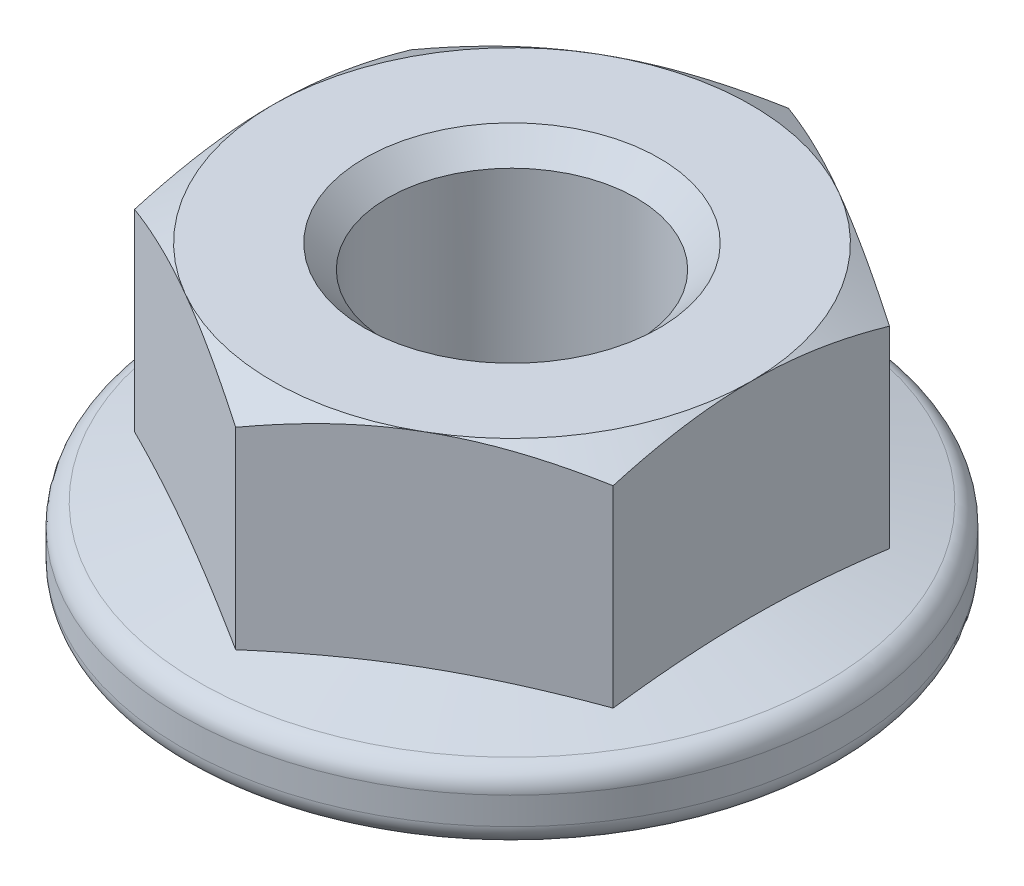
ISO-10303-21;
HEADER;
FILE_DESCRIPTION(('STEP AP214'),'2;1');
FILE_NAME('part.step','',(''),(''),'','','');
FILE_SCHEMA(('AUTOMOTIVE_DESIGN { 1 0 10303 214 1 1 1 1 }'));
ENDSEC;
DATA;
#1=APPLICATION_CONTEXT('core data for automotive mechanical design processes');
#2=APPLICATION_PROTOCOL_DEFINITION('international standard','automotive_design',2000,#1);
#3=PRODUCT_CONTEXT('',#1,'mechanical');
#4=PRODUCT('Part','Part','',(#3));
#5=PRODUCT_RELATED_PRODUCT_CATEGORY('part','',(#4));
#6=PRODUCT_DEFINITION_FORMATION('','',#4);
#7=PRODUCT_DEFINITION_CONTEXT('part definition',#1,'design');
#8=PRODUCT_DEFINITION('design','',#6,#7);
#9=PRODUCT_DEFINITION_SHAPE('','',#8);
#10=(LENGTH_UNIT() NAMED_UNIT(*) SI_UNIT(.MILLI.,.METRE.));
#11=(NAMED_UNIT(*) PLANE_ANGLE_UNIT() SI_UNIT($,.RADIAN.));
#12=(NAMED_UNIT(*) SI_UNIT($,.STERADIAN.) SOLID_ANGLE_UNIT());
#13=UNCERTAINTY_MEASURE_WITH_UNIT(LENGTH_MEASURE(1.E-05),#10,'distance_accuracy_value','');
#14=(GEOMETRIC_REPRESENTATION_CONTEXT(3) GLOBAL_UNCERTAINTY_ASSIGNED_CONTEXT((#13)) GLOBAL_UNIT_ASSIGNED_CONTEXT((#10,
#11,#12)) REPRESENTATION_CONTEXT('',''));
#15=CARTESIAN_POINT('',(0.,0.,0.));
#16=DIRECTION('',(0.,0.,1.));
#17=DIRECTION('',(1.,0.,0.));
#18=AXIS2_PLACEMENT_3D('',#15,#16,#17);
#19=CARTESIAN_POINT('',(0.,-6.660396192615,0.));
#20=DIRECTION('',(0.,-1.,0.));
#21=DIRECTION('',(0.,0.,-1.));
#22=AXIS2_PLACEMENT_3D('',#19,#20,#21);
#23=CYLINDRICAL_SURFACE('',#22,8.95);
#24=CARTESIAN_POINT('',(0.,-7.4,0.));
#25=DIRECTION('',(0.,-1.,0.));
#26=DIRECTION('',(0.999990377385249,0.,0.00438692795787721));
#27=AXIS2_PLACEMENT_3D('',#24,#25,#26);
#28=CIRCLE('',#27,8.95);
#29=CARTESIAN_POINT('',(8.94991387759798,-7.4,0.0392630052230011));
#30=VERTEX_POINT('',#29);
#31=EDGE_CURVE('E519',#30,#30,#28,.T.);
#32=ORIENTED_EDGE('',*,*,#31,.F.);
#33=EDGE_LOOP('',(#32));
#34=FACE_BOUND('',#33,.T.);
#35=CARTESIAN_POINT('',(0.,-6.660396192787,0.));
#36=DIRECTION('',(0.,-1.,0.));
#37=DIRECTION('',(-0.999987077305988,0.,-0.00508381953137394));
#38=AXIS2_PLACEMENT_3D('',#35,#36,#37);
#39=CIRCLE('',#38,8.95);
#40=CARTESIAN_POINT('',(-8.94988434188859,-6.660396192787,-0.0455001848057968));
#41=VERTEX_POINT('',#40);
#42=EDGE_CURVE('E107',#41,#41,#39,.F.);
#43=ORIENTED_EDGE('',*,*,#42,.F.);
#44=EDGE_LOOP('',(#43));
#45=FACE_BOUND('',#44,.T.);
#46=ADVANCED_FACE('F14',(#34,#45),#23,.T.);
#47=CARTESIAN_POINT('',(0.,-7.4,0.));
#48=DIRECTION('',(0.,-1.,0.));
#49=DIRECTION('',(0.999990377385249,0.,0.00438692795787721));
#50=AXIS2_PLACEMENT_3D('',#47,#48,#49);
#51=TOROIDAL_SURFACE('',#50,8.35,0.6);
#52=CARTESIAN_POINT('',(0.,-8.,0.));
#53=DIRECTION('',(0.,1.,0.));
#54=DIRECTION('',(-1.,0.,0.));
#55=AXIS2_PLACEMENT_3D('',#52,#53,#54);
#56=CIRCLE('',#55,8.350000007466);
#57=CARTESIAN_POINT('',(8.3500000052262,-8.,0.));
#58=VERTEX_POINT('',#57);
#59=CARTESIAN_POINT('',(-8.3500000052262,-8.,0.));
#60=VERTEX_POINT('',#59);
#61=EDGE_CURVE('E94',#58,#60,#56,.F.);
#62=ORIENTED_EDGE('',*,*,#61,.F.);
#63=CARTESIAN_POINT('',(0.,-8.,0.));
#64=DIRECTION('',(0.,1.,0.));
#65=DIRECTION('',(1.,0.,0.));
#66=AXIS2_PLACEMENT_3D('',#63,#64,#65);
#67=CIRCLE('',#66,8.350000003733);
#68=EDGE_CURVE('E97',#60,#58,#67,.F.);
#69=ORIENTED_EDGE('',*,*,#68,.F.);
#70=EDGE_LOOP('',(#62,#69));
#71=FACE_BOUND('',#70,.T.);
#72=ORIENTED_EDGE('',*,*,#31,.T.);
#73=EDGE_LOOP('',(#72));
#74=FACE_BOUND('',#73,.T.);
#75=ADVANCED_FACE('F105',(#71,#74),#51,.T.);
#76=CARTESIAN_POINT('',(0.,-6.660396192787,0.));
#77=DIRECTION('',(0.,-1.,0.));
#78=DIRECTION('',(-0.999987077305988,0.,-0.00508381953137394));
#79=AXIS2_PLACEMENT_3D('',#76,#77,#78);
#80=TOROIDAL_SURFACE('',#79,8.35,0.6);
#81=ORIENTED_EDGE('',*,*,#42,.T.);
#82=EDGE_LOOP('',(#81));
#83=FACE_BOUND('',#82,.T.);
#84=CARTESIAN_POINT('',(0.,-6.08084069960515,0.));
#85=DIRECTION('',(0.,-1.,0.));
#86=DIRECTION('',(-1.,0.,0.));
#87=AXIS2_PLACEMENT_3D('',#84,#85,#86);
#88=CIRCLE('',#87,8.50529143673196);
#89=CARTESIAN_POINT('',(-8.50529143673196,-6.08084069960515,0.));
#90=VERTEX_POINT('',#89);
#91=EDGE_CURVE('E102',#90,#90,#88,.F.);
#92=ORIENTED_EDGE('',*,*,#91,.F.);
#93=EDGE_LOOP('',(#92));
#94=FACE_BOUND('',#93,.T.);
#95=ADVANCED_FACE('F343',(#83,#94),#80,.T.);
#96=CARTESIAN_POINT('',(0.,-8.,0.));
#97=DIRECTION('',(0.,-1.,0.));
#98=DIRECTION('',(0.,0.,-1.));
#99=AXIS2_PLACEMENT_3D('',#96,#97,#98);
#100=PLANE('',#99);
#101=CARTESIAN_POINT('',(0.,-7.99999999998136,0.));
#102=DIRECTION('',(0.,-1.,0.));
#103=DIRECTION('',(0.,0.,-1.));
#104=AXIS2_PLACEMENT_3D('',#101,#102,#103);
#105=CIRCLE('',#104,4.00000000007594);
#106=CARTESIAN_POINT('',(0.,-7.99999999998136,-4.00000000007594));
#107=VERTEX_POINT('',#106);
#108=EDGE_CURVE('E109',#107,#107,#105,.F.);
#109=ORIENTED_EDGE('',*,*,#108,.T.);
#110=EDGE_LOOP('',(#109));
#111=FACE_BOUND('',#110,.T.);
#112=ORIENTED_EDGE('',*,*,#61,.T.);
#113=ORIENTED_EDGE('',*,*,#68,.T.);
#114=EDGE_LOOP('',(#112,#113));
#115=FACE_BOUND('',#114,.T.);
#116=ADVANCED_FACE('F99',(#111,#115),#100,.T.);
#117=CARTESIAN_POINT('',(0.,-6.08084069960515,0.));
#118=DIRECTION('',(0.,-1.,0.));
#119=DIRECTION('',(0.,0.,-1.));
#120=AXIS2_PLACEMENT_3D('',#117,#118,#119);
#121=CONICAL_SURFACE('',#120,8.50529143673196,1.3089969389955);
#122=CARTESIAN_POINT('',(6.49999999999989,-5.81296172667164,3.75277674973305));
#123=CARTESIAN_POINT('',(6.49999999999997,-5.77118780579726,3.4410899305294));
#124=CARTESIAN_POINT('',(6.49999999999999,-5.73326410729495,3.12883802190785));
#125=CARTESIAN_POINT('',(6.50000000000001,-5.66663588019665,2.50323156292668));
#126=CARTESIAN_POINT('',(6.5,-5.63793509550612,2.18987661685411));
#127=CARTESIAN_POINT('',(6.50000000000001,-5.5914280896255,1.56396377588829));
#128=CARTESIAN_POINT('',(6.50000000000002,-5.57356641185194,1.2514101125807));
#129=CARTESIAN_POINT('',(6.49999999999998,-5.54961574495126,0.625904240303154));
#130=CARTESIAN_POINT('',(6.49999999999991,-5.54352447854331,0.312952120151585));
#131=CARTESIAN_POINT('',(6.49999999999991,-5.54352447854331,-0.312952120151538));
#132=CARTESIAN_POINT('',(6.49999999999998,-5.54961574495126,-0.625904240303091));
#133=CARTESIAN_POINT('',(6.50000000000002,-5.57356641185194,-1.25141011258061));
#134=CARTESIAN_POINT('',(6.50000000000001,-5.5914280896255,-1.56396377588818));
#135=CARTESIAN_POINT('',(6.49999999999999,-5.63793509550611,-2.18987661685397));
#136=CARTESIAN_POINT('',(6.5,-5.66663588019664,-2.50323156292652));
#137=CARTESIAN_POINT('',(6.5,-5.73326410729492,-3.12883802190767));
#138=CARTESIAN_POINT('',(6.50000000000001,-5.7711878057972,-3.4410899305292));
#139=CARTESIAN_POINT('',(6.5,-5.81296172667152,-3.75277674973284));
#140=B_SPLINE_CURVE_WITH_KNOTS('',3,(#122,#123,#124,#125,#126,#127,#128,#129,#130,#131,#132,
#133,#134,#135,#136,#137,#138,#139),.UNSPECIFIED.,.F.,.F.,(4,2,2,2,2,2,2,2,4),(0.,
0.943470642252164,1.88732379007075,2.82630622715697,3.76510697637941,4.7039077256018,
5.64289016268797,6.58674331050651,7.53021395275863),.UNSPECIFIED.);
#141=CARTESIAN_POINT('',(6.50000000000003,-5.81296172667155,3.75277674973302));
#142=VERTEX_POINT('',#141);
#143=CARTESIAN_POINT('',(6.49999999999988,-5.81296172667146,-3.75277674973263));
#144=VERTEX_POINT('',#143);
#145=EDGE_CURVE('E86',#142,#144,#140,.T.);
#146=ORIENTED_EDGE('',*,*,#145,.F.);
#147=CARTESIAN_POINT('',(2.71094881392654E-13,-5.8129617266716,7.50555349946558));
#148=CARTESIAN_POINT('',(0.269928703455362,-5.7711878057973,7.34971008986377));
#149=CARTESIAN_POINT('',(0.540346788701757,-5.73326410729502,7.19358413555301));
#150=CARTESIAN_POINT('',(1.08213787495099,-5.66663588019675,6.88078090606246));
#151=CARTESIAN_POINT('',(1.35351121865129,-5.63793509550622,6.7241034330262));
#152=CARTESIAN_POINT('',(1.8955676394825,-5.59142808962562,6.41114701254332));
#153=CARTESIAN_POINT('',(2.16624705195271,-5.57356641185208,6.25487018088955));
#154=CARTESIAN_POINT('',(2.70795102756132,-5.54961574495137,5.94211724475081));
#155=CARTESIAN_POINT('',(2.97897551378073,-5.54352447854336,5.78564118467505));
#156=CARTESIAN_POINT('',(3.52102448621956,-5.54352447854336,5.47268906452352));
#157=CARTESIAN_POINT('',(3.79204897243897,-5.54961574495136,5.31621300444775));
#158=CARTESIAN_POINT('',(4.33375294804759,-5.57356641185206,5.00346006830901));
#159=CARTESIAN_POINT('',(4.6044323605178,-5.59142808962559,4.84718323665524));
#160=CARTESIAN_POINT('',(5.146488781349,-5.63793509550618,4.53422681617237));
#161=CARTESIAN_POINT('',(5.4178621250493,-5.66663588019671,4.3775493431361));
#162=CARTESIAN_POINT('',(5.95965321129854,-5.73326410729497,4.06474611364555));
#163=CARTESIAN_POINT('',(6.23007129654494,-5.77118780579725,3.9086201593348));
#164=CARTESIAN_POINT('',(6.50000000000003,-5.81296172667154,3.75277674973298));
#165=B_SPLINE_CURVE_WITH_KNOTS('',3,(#147,#148,#149,#150,#151,#152,#153,#154,#155,#156,#157,
#158,#159,#160,#161,#162,#163,#164),.UNSPECIFIED.,.F.,.F.,(4,2,2,2,2,2,2,2,4),(0.,
0.943470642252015,1.88732379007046,2.82630622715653,3.76510697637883,4.70390772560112,
5.64289016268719,6.58674331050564,7.53021395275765),.UNSPECIFIED.);
#166=CARTESIAN_POINT('',(2.61171548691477E-13,-5.81296172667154,7.50555349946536));
#167=VERTEX_POINT('',#166);
#168=EDGE_CURVE('E303',#167,#142,#165,.T.);
#169=ORIENTED_EDGE('',*,*,#168,.F.);
#170=CARTESIAN_POINT('',(-6.49999999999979,-5.81296172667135,3.75277674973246));
#171=CARTESIAN_POINT('',(-6.23007129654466,-5.77118780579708,3.90862015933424));
#172=CARTESIAN_POINT('',(-5.95965321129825,-5.73326410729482,4.06474611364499));
#173=CARTESIAN_POINT('',(-5.41786212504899,-5.66663588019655,4.37754934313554));
#174=CARTESIAN_POINT('',(-5.14648878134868,-5.63793509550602,4.53422681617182));
#175=CARTESIAN_POINT('',(-4.60443236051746,-5.59142808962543,4.84718323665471));
#176=CARTESIAN_POINT('',(-4.33375294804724,-5.57356641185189,5.00346006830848));
#177=CARTESIAN_POINT('',(-3.7920489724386,-5.54961574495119,5.31621300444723));
#178=CARTESIAN_POINT('',(-3.52102448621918,-5.54352447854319,5.472689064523));
#179=CARTESIAN_POINT('',(-2.97897551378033,-5.54352447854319,5.78564118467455));
#180=CARTESIAN_POINT('',(-2.70795102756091,-5.5496157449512,5.94211724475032));
#181=CARTESIAN_POINT('',(-2.16624705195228,-5.57356641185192,6.25487018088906));
#182=CARTESIAN_POINT('',(-1.89556763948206,-5.59142808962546,6.41114701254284));
#183=CARTESIAN_POINT('',(-1.35351121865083,-5.63793509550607,6.72410343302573));
#184=CARTESIAN_POINT('',(-1.08213787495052,-5.6666358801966,6.880780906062));
#185=CARTESIAN_POINT('',(-0.540346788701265,-5.73326410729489,7.19358413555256));
#186=CARTESIAN_POINT('',(-0.26992870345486,-5.77118780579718,7.34971008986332));
#187=CARTESIAN_POINT('',(2.40259230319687E-13,-5.81296172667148,7.50555349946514));
#188=B_SPLINE_CURVE_WITH_KNOTS('',3,(#170,#171,#172,#173,#174,#175,#176,#177,#178,#179,#180,
#181,#182,#183,#184,#185,#186,#187),.UNSPECIFIED.,.F.,.F.,(4,2,2,2,2,2,2,2,4),(0.,
0.94347064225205,1.88732379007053,2.82630622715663,3.76510697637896,4.70390772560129,
5.6428901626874,6.58674331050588,7.53021395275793),.UNSPECIFIED.);
#189=CARTESIAN_POINT('',(-6.49999999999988,-5.81296172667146,3.75277674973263));
#190=VERTEX_POINT('',#189);
#191=EDGE_CURVE('E293',#190,#167,#188,.T.);
#192=ORIENTED_EDGE('',*,*,#191,.F.);
#193=CARTESIAN_POINT('',(-6.49999999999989,-5.81296172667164,-3.75277674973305));
#194=CARTESIAN_POINT('',(-6.49999999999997,-5.77118780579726,-3.4410899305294));
#195=CARTESIAN_POINT('',(-6.49999999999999,-5.73326410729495,-3.12883802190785));
#196=CARTESIAN_POINT('',(-6.50000000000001,-5.66663588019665,-2.50323156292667));
#197=CARTESIAN_POINT('',(-6.5,-5.63793509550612,-2.1898766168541));
#198=CARTESIAN_POINT('',(-6.50000000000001,-5.5914280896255,-1.56396377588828));
#199=CARTESIAN_POINT('',(-6.50000000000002,-5.57356641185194,-1.25141011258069));
#200=CARTESIAN_POINT('',(-6.49999999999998,-5.54961574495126,-0.625904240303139));
#201=CARTESIAN_POINT('',(-6.49999999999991,-5.54352447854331,-0.312952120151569));
#202=CARTESIAN_POINT('',(-6.49999999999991,-5.54352447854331,0.312952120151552));
#203=CARTESIAN_POINT('',(-6.49999999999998,-5.54961574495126,0.625904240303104));
#204=CARTESIAN_POINT('',(-6.50000000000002,-5.57356641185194,1.25141011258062));
#205=CARTESIAN_POINT('',(-6.50000000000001,-5.5914280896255,1.56396377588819));
#206=CARTESIAN_POINT('',(-6.49999999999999,-5.63793509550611,2.18987661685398));
#207=CARTESIAN_POINT('',(-6.5,-5.66663588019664,2.50323156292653));
#208=CARTESIAN_POINT('',(-6.5,-5.73326410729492,3.12883802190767));
#209=CARTESIAN_POINT('',(-6.50000000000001,-5.7711878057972,3.4410899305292));
#210=CARTESIAN_POINT('',(-6.5,-5.81296172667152,3.75277674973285));
#211=B_SPLINE_CURVE_WITH_KNOTS('',3,(#193,#194,#195,#196,#197,#198,#199,#200,#201,#202,#203,
#204,#205,#206,#207,#208,#209,#210),.UNSPECIFIED.,.F.,.F.,(4,2,2,2,2,2,2,2,4),(0.,
0.943470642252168,1.88732379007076,2.82630622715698,3.76510697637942,4.70390772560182,
5.64289016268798,6.58674331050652,7.53021395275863),.UNSPECIFIED.);
#212=CARTESIAN_POINT('',(-6.50000000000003,-5.81296172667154,-3.75277674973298));
#213=VERTEX_POINT('',#212);
#214=EDGE_CURVE('E161',#213,#190,#211,.T.);
#215=ORIENTED_EDGE('',*,*,#214,.F.);
#216=CARTESIAN_POINT('',(-2.24740393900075E-13,-5.81296172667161,-7.50555349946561));
#217=CARTESIAN_POINT('',(-0.269928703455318,-5.77118780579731,-7.34971008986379));
#218=CARTESIAN_POINT('',(-0.540346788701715,-5.73326410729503,-7.19358413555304));
#219=CARTESIAN_POINT('',(-1.08213787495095,-5.66663588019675,-6.88078090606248));
#220=CARTESIAN_POINT('',(-1.35351121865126,-5.63793509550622,-6.72410343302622));
#221=CARTESIAN_POINT('',(-1.89556763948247,-5.59142808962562,-6.41114701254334));
#222=CARTESIAN_POINT('',(-2.16624705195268,-5.57356641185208,-6.25487018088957));
#223=CARTESIAN_POINT('',(-2.7079510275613,-5.54961574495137,-5.94211724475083));
#224=CARTESIAN_POINT('',(-2.97897551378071,-5.54352447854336,-5.78564118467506));
#225=CARTESIAN_POINT('',(-3.52102448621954,-5.54352447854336,-5.47268906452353));
#226=CARTESIAN_POINT('',(-3.79204897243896,-5.54961574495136,-5.31621300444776));
#227=CARTESIAN_POINT('',(-4.33375294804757,-5.57356641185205,-5.00346006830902));
#228=CARTESIAN_POINT('',(-4.60443236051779,-5.59142808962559,-4.84718323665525));
#229=CARTESIAN_POINT('',(-5.146488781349,-5.63793509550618,-4.53422681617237));
#230=CARTESIAN_POINT('',(-5.4178621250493,-5.66663588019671,-4.37754934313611));
#231=CARTESIAN_POINT('',(-5.95965321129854,-5.73326410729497,-4.06474611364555));
#232=CARTESIAN_POINT('',(-6.23007129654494,-5.77118780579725,-3.90862015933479));
#233=CARTESIAN_POINT('',(-6.50000000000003,-5.81296172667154,-3.75277674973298));
#234=B_SPLINE_CURVE_WITH_KNOTS('',3,(#216,#217,#218,#219,#220,#221,#222,#223,#224,#225,#226,
#227,#228,#229,#230,#231,#232,#233),.UNSPECIFIED.,.F.,.F.,(4,2,2,2,2,2,2,2,4),(0.,
0.943470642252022,1.88732379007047,2.82630622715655,3.76510697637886,4.70390772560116,
5.64289016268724,6.58674331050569,7.53021395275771),.UNSPECIFIED.);
#235=CARTESIAN_POINT('',(-3.07736089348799E-13,-5.81296172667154,-7.50555349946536));
#236=VERTEX_POINT('',#235);
#237=EDGE_CURVE('E299',#236,#213,#234,.T.);
#238=ORIENTED_EDGE('',*,*,#237,.F.);
#239=CARTESIAN_POINT('',(6.49999999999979,-5.81296172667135,-3.75277674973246));
#240=CARTESIAN_POINT('',(6.23007129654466,-5.77118780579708,-3.90862015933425));
#241=CARTESIAN_POINT('',(5.95965321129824,-5.73326410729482,-4.06474611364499));
#242=CARTESIAN_POINT('',(5.41786212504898,-5.66663588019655,-4.37754934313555));
#243=CARTESIAN_POINT('',(5.14648878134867,-5.63793509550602,-4.53422681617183));
#244=CARTESIAN_POINT('',(4.60443236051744,-5.59142808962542,-4.84718323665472));
#245=CARTESIAN_POINT('',(4.33375294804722,-5.57356641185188,-5.00346006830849));
#246=CARTESIAN_POINT('',(3.79204897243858,-5.54961574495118,-5.31621300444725));
#247=CARTESIAN_POINT('',(3.52102448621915,-5.54352447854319,-5.47268906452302));
#248=CARTESIAN_POINT('',(2.9789755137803,-5.54352447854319,-5.78564118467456));
#249=CARTESIAN_POINT('',(2.70795102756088,-5.5496157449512,-5.94211724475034));
#250=CARTESIAN_POINT('',(2.16624705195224,-5.57356641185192,-6.25487018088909));
#251=CARTESIAN_POINT('',(1.89556763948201,-5.59142808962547,-6.41114701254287));
#252=CARTESIAN_POINT('',(1.35351121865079,-5.63793509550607,-6.72410343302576));
#253=CARTESIAN_POINT('',(1.08213787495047,-5.66663588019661,-6.88078090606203));
#254=CARTESIAN_POINT('',(0.540346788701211,-5.7332641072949,-7.19358413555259));
#255=CARTESIAN_POINT('',(0.269928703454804,-5.77118780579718,-7.34971008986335));
#256=CARTESIAN_POINT('',(-2.98112878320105E-13,-5.81296172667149,-7.50555349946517));
#257=B_SPLINE_CURVE_WITH_KNOTS('',3,(#239,#240,#241,#242,#243,#244,#245,#246,#247,#248,#249,
#250,#251,#252,#253,#254,#255,#256),.UNSPECIFIED.,.F.,.F.,(4,2,2,2,2,2,2,2,4),(0.,
0.943470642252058,1.88732379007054,2.82630622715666,3.765106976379,4.70390772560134,
5.64289016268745,6.58674331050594,7.530213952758),.UNSPECIFIED.);
#258=EDGE_CURVE('E112',#144,#236,#257,.T.);
#259=ORIENTED_EDGE('',*,*,#258,.F.);
#260=EDGE_LOOP('',(#146,#169,#192,#215,#238,#259));
#261=FACE_BOUND('',#260,.T.);
#262=ORIENTED_EDGE('',*,*,#91,.T.);
#263=EDGE_LOOP('',(#262));
#264=FACE_BOUND('',#263,.T.);
#265=ADVANCED_FACE('F125',(#261,#264),#121,.T.);
#266=CARTESIAN_POINT('',(0.,-7.99999999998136,0.));
#267=DIRECTION('',(0.,-1.,0.));
#268=DIRECTION('',(0.,0.,-1.));
#269=AXIS2_PLACEMENT_3D('',#266,#267,#268);
#270=CONICAL_SURFACE('',#269,4.00000000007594,0.785398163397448);
#271=CARTESIAN_POINT('',(0.,-7.375,0.));
#272=DIRECTION('',(0.,-1.,0.));
#273=DIRECTION('',(1.,0.,0.));
#274=AXIS2_PLACEMENT_3D('',#271,#272,#273);
#275=CIRCLE('',#274,3.375);
#276=CARTESIAN_POINT('',(3.375,-7.375,0.));
#277=VERTEX_POINT('',#276);
#278=EDGE_CURVE('E156',#277,#277,#275,.F.);
#279=ORIENTED_EDGE('',*,*,#278,.T.);
#280=EDGE_LOOP('',(#279));
#281=FACE_BOUND('',#280,.T.);
#282=ORIENTED_EDGE('',*,*,#108,.F.);
#283=EDGE_LOOP('',(#282));
#284=FACE_BOUND('',#283,.T.);
#285=ADVANCED_FACE('F133',(#281,#284),#270,.F.);
#286=CARTESIAN_POINT('',(0.,0.,-7.505553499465));
#287=DIRECTION('',(0.500000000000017,0.,-0.866025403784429));
#288=DIRECTION('',(-0.866025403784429,0.,-0.500000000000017));
#289=AXIS2_PLACEMENT_3D('',#286,#287,#288);
#290=PLANE('',#289);
#291=CARTESIAN_POINT('',(3.24999999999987,5.13517653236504E-13,-5.62916512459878));
#292=CARTESIAN_POINT('',(3.11205573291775,2.6565257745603E-05,-5.70880728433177));
#293=CARTESIAN_POINT('',(2.97411811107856,-0.00337972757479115,-5.78844560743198));
#294=CARTESIAN_POINT('',(2.69851370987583,-0.0168605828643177,-5.94756588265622));
#295=CARTESIAN_POINT('',(2.56084688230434,-0.0269338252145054,-6.02704786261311));
#296=CARTESIAN_POINT('',(2.28667328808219,-0.0534848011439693,-6.18534206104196));
#297=CARTESIAN_POINT('',(2.15016416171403,-0.0699302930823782,-6.26415564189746));
#298=CARTESIAN_POINT('',(1.87779628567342,-0.108872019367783,-6.42140730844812));
#299=CARTESIAN_POINT('',(1.74193755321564,-0.131368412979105,-6.49984538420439));
#300=CARTESIAN_POINT('',(1.33590009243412,-0.20723897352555,-6.73427122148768));
#301=CARTESIAN_POINT('',(1.06690091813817,-0.269031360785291,-6.88957796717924));
#302=CARTESIAN_POINT('',(0.531215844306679,-0.411540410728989,-7.19885588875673));
#303=CARTESIAN_POINT('',(0.264548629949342,-0.492351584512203,-7.35281627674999));
#304=CARTESIAN_POINT('',(1.59499656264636E-08,-0.580556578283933,-7.50555349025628));
#305=B_SPLINE_CURVE_WITH_KNOTS('',3,(#291,#292,#293,#294,#295,#296,#297,#298,#299,#300,#301,
#302,#303,#304),.UNSPECIFIED.,.F.,.F.,(4,2,2,2,2,2,4),(0.,0.477804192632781,0.955513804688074,
1.430837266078,1.90617323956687,2.85559934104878,3.80984699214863),.UNSPECIFIED.);
#306=CARTESIAN_POINT('',(3.24999999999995,3.46741542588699E-13,-5.62916512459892));
#307=VERTEX_POINT('',#306);
#308=CARTESIAN_POINT('',(7.10287381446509E-09,-0.58055658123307,-7.50555349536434));
#309=VERTEX_POINT('',#308);
#310=EDGE_CURVE('E148',#307,#309,#305,.T.);
#311=ORIENTED_EDGE('',*,*,#310,.F.);
#312=CARTESIAN_POINT('',(6.50000005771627,-0.580556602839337,-3.75277671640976));
#313=CARTESIAN_POINT('',(6.23545143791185,-0.492351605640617,-3.9055139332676));
#314=CARTESIAN_POINT('',(5.96878421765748,-0.411540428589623,-4.05947432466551));
#315=CARTESIAN_POINT('',(5.43309913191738,-0.269031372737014,-4.36875225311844));
#316=CARTESIAN_POINT('',(5.16409995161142,-0.20723898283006,-4.52405900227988));
#317=CARTESIAN_POINT('',(4.7580624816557,-0.131368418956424,-4.7584848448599));
#318=CARTESIAN_POINT('',(4.62220374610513,-0.108872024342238,-4.83692292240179));
#319=CARTESIAN_POINT('',(4.34983586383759,-0.0699302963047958,-4.99417459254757));
#320=CARTESIAN_POINT('',(4.2133267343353,-0.0534848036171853,-5.07298817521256));
#321=CARTESIAN_POINT('',(3.93915313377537,-0.0269338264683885,-5.23128237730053));
#322=CARTESIAN_POINT('',(3.80148630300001,-0.0168605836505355,-5.31076435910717));
#323=CARTESIAN_POINT('',(3.52588189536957,-0.00337972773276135,-5.46988463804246));
#324=CARTESIAN_POINT('',(3.38794427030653,2.6565260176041E-05,-5.54952296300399));
#325=CARTESIAN_POINT('',(3.24999999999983,4.74470995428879E-13,-5.62916512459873));
#326=B_SPLINE_CURVE_WITH_KNOTS('',3,(#312,#313,#314,#315,#316,#317,#318,#319,#320,#321,#322,
#323,#324,#325),.UNSPECIFIED.,.F.,.F.,(4,2,2,2,2,2,4),(0.,0.954247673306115,1.90367379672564,
2.37900978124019,2.85433325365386,3.33204287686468,3.80984708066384),.UNSPECIFIED.);
#327=CARTESIAN_POINT('',(6.5,-0.580556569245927,-3.75277670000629));
#328=VERTEX_POINT('',#327);
#329=EDGE_CURVE('E140',#328,#307,#326,.T.);
#330=ORIENTED_EDGE('',*,*,#329,.F.);
#331=DIRECTION('',(0.,1.,0.));
#332=VECTOR('',#331,1.);
#333=CARTESIAN_POINT('',(6.5,0.,-3.752776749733));
#334=LINE('',#333,#332);
#335=EDGE_CURVE('E308',#144,#328,#334,.T.);
#336=ORIENTED_EDGE('',*,*,#335,.F.);
#337=ORIENTED_EDGE('',*,*,#258,.T.);
#338=DIRECTION('',(0.,1.,0.));
#339=VECTOR('',#338,1.);
#340=CARTESIAN_POINT('',(-3.17454396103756E-13,0.,-7.50555349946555));
#341=LINE('',#340,#339);
#342=EDGE_CURVE('E319',#309,#236,#341,.F.);
#343=ORIENTED_EDGE('',*,*,#342,.F.);
#344=EDGE_LOOP('',(#311,#330,#336,#337,#343));
#345=FACE_BOUND('',#344,.T.);
#346=ADVANCED_FACE('F129',(#345),#290,.T.);
#347=CARTESIAN_POINT('',(6.5,0.,-3.752776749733));
#348=DIRECTION('',(1.,0.,0.));
#349=DIRECTION('',(0.,0.,-1.));
#350=AXIS2_PLACEMENT_3D('',#347,#348,#349);
#351=PLANE('',#350);
#352=CARTESIAN_POINT('',(6.49999999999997,3.45741467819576E-13,0.));
#353=CARTESIAN_POINT('',(6.49999999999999,2.65652553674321E-05,-0.159284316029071));
#354=CARTESIAN_POINT('',(6.5,-0.0033797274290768,-0.318560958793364));
#355=CARTESIAN_POINT('',(6.5,-0.0168605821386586,-0.636801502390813));
#356=CARTESIAN_POINT('',(6.5,-0.0269338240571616,-0.795765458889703));
#357=CARTESIAN_POINT('',(6.5,-0.0534847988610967,-1.11235384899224));
#358=CARTESIAN_POINT('',(6.5,-0.0699302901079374,-1.26998100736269));
#359=CARTESIAN_POINT('',(6.5,-0.108872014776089,-1.58448433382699));
#360=CARTESIAN_POINT('',(6.5,-0.131368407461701,-1.74136048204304));
#361=CARTESIAN_POINT('',(6.5,-0.207238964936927,-2.21021214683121));
#362=CARTESIAN_POINT('',(6.5,-0.269031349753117,-2.52082563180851));
#363=CARTESIAN_POINT('',(6.5,-0.411540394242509,-3.13938146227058));
#364=CARTESIAN_POINT('',(6.5,-0.492351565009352,-3.4473022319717));
#365=CARTESIAN_POINT('',(6.5,-0.580556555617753,-3.75277665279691));
#366=B_SPLINE_CURVE_WITH_KNOTS('',3,(#352,#353,#354,#355,#356,#357,#358,#359,#360,#361,#362,
#363,#364,#365),.UNSPECIFIED.,.F.,.F.,(4,2,2,2,2,2,4),(0.,0.477804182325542,0.955513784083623,
1.43083723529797,1.90617319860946,2.85559927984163,3.80984691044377),.UNSPECIFIED.);
#367=CARTESIAN_POINT('',(6.50000000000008,3.19421865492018E-13,0.));
#368=VERTEX_POINT('',#367);
#369=EDGE_CURVE('E183',#368,#328,#366,.T.);
#370=ORIENTED_EDGE('',*,*,#369,.F.);
#371=CARTESIAN_POINT('',(6.5,-0.580556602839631,3.75277681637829));
#372=CARTESIAN_POINT('',(6.5,-0.49235160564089,3.4473023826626));
#373=CARTESIAN_POINT('',(6.5,-0.411540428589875,3.13938159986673));
#374=CARTESIAN_POINT('',(6.5,-0.269031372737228,2.52082574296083));
#375=CARTESIAN_POINT('',(6.5,-0.207238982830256,2.21021224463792));
#376=CARTESIAN_POINT('',(6.5,-0.131368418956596,1.74136055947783));
#377=CARTESIAN_POINT('',(6.5,-0.108872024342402,1.58448440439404));
#378=CARTESIAN_POINT('',(6.5,-0.0699302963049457,1.26998106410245));
#379=CARTESIAN_POINT('',(6.5,-0.0534848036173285,1.11235389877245));
#380=CARTESIAN_POINT('',(6.5,-0.0269338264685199,0.795765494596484));
#381=CARTESIAN_POINT('',(6.5,-0.0168605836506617,0.636801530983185));
#382=CARTESIAN_POINT('',(6.5,-0.00337972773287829,0.318560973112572));
#383=CARTESIAN_POINT('',(6.5,2.65652600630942E-05,0.159284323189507));
#384=CARTESIAN_POINT('',(6.5,3.65004575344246E-13,0.));
#385=B_SPLINE_CURVE_WITH_KNOTS('',3,(#371,#372,#373,#374,#375,#376,#377,#378,#379,#380,#381,
#382,#383,#384),.UNSPECIFIED.,.F.,.F.,(4,2,2,2,2,2,4),(0.,0.95424767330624,1.90367379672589,
2.3790097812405,2.85433325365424,3.33204287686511,3.80984708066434),.UNSPECIFIED.);
#386=CARTESIAN_POINT('',(6.49999995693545,-0.580556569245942,3.75277677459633));
#387=VERTEX_POINT('',#386);
#388=EDGE_CURVE('E280',#387,#368,#385,.T.);
#389=ORIENTED_EDGE('',*,*,#388,.F.);
#390=DIRECTION('',(0.,1.,0.));
#391=VECTOR('',#390,1.);
#392=CARTESIAN_POINT('',(6.5,0.,3.752776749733));
#393=LINE('',#392,#391);
#394=EDGE_CURVE('E298',#142,#387,#393,.T.);
#395=ORIENTED_EDGE('',*,*,#394,.F.);
#396=ORIENTED_EDGE('',*,*,#145,.T.);
#397=ORIENTED_EDGE('',*,*,#335,.T.);
#398=EDGE_LOOP('',(#370,#389,#395,#396,#397));
#399=FACE_BOUND('',#398,.T.);
#400=ADVANCED_FACE('F132',(#399),#351,.T.);
#401=CARTESIAN_POINT('',(6.5,0.,3.752776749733));
#402=DIRECTION('',(0.500000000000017,0.,0.866025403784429));
#403=DIRECTION('',(0.866025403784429,0.,-0.500000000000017));
#404=AXIS2_PLACEMENT_3D('',#401,#402,#403);
#405=PLANE('',#404);
#406=CARTESIAN_POINT('',(3.25000000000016,1.06583977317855E-13,5.62916512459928));
#407=CARTESIAN_POINT('',(3.38794426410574,2.65652551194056E-05,5.54952296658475));
#408=CARTESIAN_POINT('',(3.5258818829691,-0.00337972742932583,5.46988464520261));
#409=CARTESIAN_POINT('',(3.80148627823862,-0.0168605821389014,5.3107643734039));
#410=CARTESIAN_POINT('',(3.93915310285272,-0.0269338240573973,5.23128239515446));
#411=CARTESIAN_POINT('',(4.2133266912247,-0.0534847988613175,5.07298820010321));
#412=CARTESIAN_POINT('',(4.34983581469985,-0.0699302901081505,4.99417462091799));
#413=CARTESIAN_POINT('',(4.6222036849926,-0.108872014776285,4.83692295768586));
#414=CARTESIAN_POINT('',(4.75806241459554,-0.131368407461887,4.75848488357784));
#415=CARTESIAN_POINT('',(5.16409986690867,-0.207238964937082,4.52405905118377));
#416=CARTESIAN_POINT('',(5.43309903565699,-0.26903134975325,4.36875230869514));
#417=CARTESIAN_POINT('',(5.96878409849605,-0.411540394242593,4.05947439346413));
#418=CARTESIAN_POINT('',(6.23545130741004,-0.49235156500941,3.90551400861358));
#419=CARTESIAN_POINT('',(6.49999991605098,-0.580556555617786,3.75277679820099));
#420=B_SPLINE_CURVE_WITH_KNOTS('',3,(#406,#407,#408,#409,#410,#411,#412,#413,#414,#415,#416,
#417,#418,#419),.UNSPECIFIED.,.F.,.F.,(4,2,2,2,2,2,4),(0.,0.477804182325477,0.955513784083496,
1.43083723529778,1.90617319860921,2.85559927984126,3.80984691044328),.UNSPECIFIED.);
#421=CARTESIAN_POINT('',(3.25000000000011,1.62721533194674E-13,5.62916512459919));
#422=VERTEX_POINT('',#421);
#423=EDGE_CURVE('E191',#422,#387,#420,.T.);
#424=ORIENTED_EDGE('',*,*,#423,.F.);
#425=CARTESIAN_POINT('',(-5.77139906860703E-08,-0.58055660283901,7.50555353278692));
#426=CARTESIAN_POINT('',(0.264548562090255,-0.492351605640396,7.35281631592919));
#427=CARTESIAN_POINT('',(0.531215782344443,-0.411540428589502,7.19885592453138));
#428=CARTESIAN_POINT('',(1.06690086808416,-0.269031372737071,6.88957799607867));
#429=CARTESIAN_POINT('',(1.33590004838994,-0.207238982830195,6.73427124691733));
#430=CARTESIAN_POINT('',(1.74193751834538,-0.131368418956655,6.49984540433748));
#431=CARTESIAN_POINT('',(1.87779625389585,-0.108872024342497,6.42140732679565));
#432=CARTESIAN_POINT('',(2.1501641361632,-0.0699302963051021,6.26415565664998));
#433=CARTESIAN_POINT('',(2.28667326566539,-0.053484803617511,6.18534207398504));
#434=CARTESIAN_POINT('',(2.56084686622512,-0.0269338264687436,6.02704787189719));
#435=CARTESIAN_POINT('',(2.69851369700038,-0.0168605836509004,5.9475658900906));
#436=CARTESIAN_POINT('',(2.97411810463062,-0.00337972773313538,5.78844561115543));
#437=CARTESIAN_POINT('',(3.11205572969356,2.65652598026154E-05,5.70880728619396));
#438=CARTESIAN_POINT('',(3.25000000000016,1.0712034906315E-13,5.62916512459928));
#439=B_SPLINE_CURVE_WITH_KNOTS('',3,(#425,#426,#427,#428,#429,#430,#431,#432,#433,#434,#435,
#436,#437,#438),.UNSPECIFIED.,.F.,.F.,(4,2,2,2,2,2,4),(0.,0.954247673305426,1.90367379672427,
2.37900978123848,2.85433325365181,3.33204287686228,3.80984708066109),.UNSPECIFIED.);
#440=CARTESIAN_POINT('',(-4.30637034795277E-08,-0.580556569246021,7.50555347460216));
#441=VERTEX_POINT('',#440);
#442=EDGE_CURVE('E256',#441,#422,#439,.T.);
#443=ORIENTED_EDGE('',*,*,#442,.F.);
#444=DIRECTION('',(0.,1.,0.));
#445=VECTOR('',#444,1.);
#446=CARTESIAN_POINT('',(0.,0.,7.505553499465));
#447=LINE('',#446,#445);
#448=EDGE_CURVE('E297',#167,#441,#447,.T.);
#449=ORIENTED_EDGE('',*,*,#448,.F.);
#450=ORIENTED_EDGE('',*,*,#168,.T.);
#451=ORIENTED_EDGE('',*,*,#394,.T.);
#452=EDGE_LOOP('',(#424,#443,#449,#450,#451));
#453=FACE_BOUND('',#452,.T.);
#454=ADVANCED_FACE('F287',(#453),#405,.T.);
#455=CARTESIAN_POINT('',(0.,0.,7.505553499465));
#456=DIRECTION('',(-0.500000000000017,0.,0.866025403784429));
#457=DIRECTION('',(0.866025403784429,0.,0.500000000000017));
#458=AXIS2_PLACEMENT_3D('',#455,#456,#457);
#459=PLANE('',#458);
#460=CARTESIAN_POINT('',(-3.24999999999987,5.13849655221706E-13,5.62916512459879));
#461=CARTESIAN_POINT('',(-3.1120557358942,2.65652554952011E-05,5.70880728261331));
#462=CARTESIAN_POINT('',(-2.97411811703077,-0.00337972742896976,5.78844560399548));
#463=CARTESIAN_POINT('',(-2.6985137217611,-0.0168605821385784,5.94756587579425));
#464=CARTESIAN_POINT('',(-2.56084689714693,-0.0269338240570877,6.02704785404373));
#465=CARTESIAN_POINT('',(-2.28667330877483,-0.0534847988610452,6.18534204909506));
#466=CARTESIAN_POINT('',(-2.15016418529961,-0.0699302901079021,6.26415562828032));
#467=CARTESIAN_POINT('',(-1.87779631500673,-0.108872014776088,6.42140729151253));
#468=CARTESIAN_POINT('',(-1.74193758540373,-0.131368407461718,6.49984536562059));
#469=CARTESIAN_POINT('',(-1.3359001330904,-0.207238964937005,6.73427119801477));
#470=CARTESIAN_POINT('',(-1.06690096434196,-0.269031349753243,6.88957794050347));
#471=CARTESIAN_POINT('',(-0.531215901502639,-0.411540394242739,7.19885585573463));
#472=CARTESIAN_POINT('',(-0.264548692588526,-0.49235156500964,7.35281624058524));
#473=CARTESIAN_POINT('',(-8.39474660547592E-08,-0.580556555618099,7.50555345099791));
#474=B_SPLINE_CURVE_WITH_KNOTS('',3,(#460,#461,#462,#463,#464,#465,#466,#467,#468,#469,#470,
#471,#472,#473),.UNSPECIFIED.,.F.,.F.,(4,2,2,2,2,2,4),(0.,0.477804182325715,0.955513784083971,
1.43083723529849,1.90617319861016,2.85559927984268,3.80984691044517),.UNSPECIFIED.);
#475=CARTESIAN_POINT('',(-3.24999999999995,3.46240249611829E-13,5.62916512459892));
#476=VERTEX_POINT('',#475);
#477=EDGE_CURVE('E274',#476,#441,#474,.T.);
#478=ORIENTED_EDGE('',*,*,#477,.F.);
#479=CARTESIAN_POINT('',(-6.50000005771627,-0.580556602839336,3.75277671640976));
#480=CARTESIAN_POINT('',(-6.23545143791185,-0.492351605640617,3.9055139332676));
#481=CARTESIAN_POINT('',(-5.96878421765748,-0.411540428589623,4.05947432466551));
#482=CARTESIAN_POINT('',(-5.43309913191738,-0.269031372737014,4.36875225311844));
#483=CARTESIAN_POINT('',(-5.16409995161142,-0.20723898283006,4.52405900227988));
#484=CARTESIAN_POINT('',(-4.7580624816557,-0.131368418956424,4.7584848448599));
#485=CARTESIAN_POINT('',(-4.62220374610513,-0.108872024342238,4.83692292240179));
#486=CARTESIAN_POINT('',(-4.34983586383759,-0.069930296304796,4.99417459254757));
#487=CARTESIAN_POINT('',(-4.2133267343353,-0.0534848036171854,5.07298817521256));
#488=CARTESIAN_POINT('',(-3.93915313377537,-0.0269338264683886,5.23128237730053));
#489=CARTESIAN_POINT('',(-3.80148630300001,-0.0168605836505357,5.31076435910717));
#490=CARTESIAN_POINT('',(-3.52588189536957,-0.00337972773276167,5.46988463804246));
#491=CARTESIAN_POINT('',(-3.38794427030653,2.65652601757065E-05,5.54952296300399));
#492=CARTESIAN_POINT('',(-3.24999999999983,4.74345846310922E-13,5.62916512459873));
#493=B_SPLINE_CURVE_WITH_KNOTS('',3,(#479,#480,#481,#482,#483,#484,#485,#486,#487,#488,#489,
#490,#491,#492),.UNSPECIFIED.,.F.,.F.,(4,2,2,2,2,2,4),(0.,0.954247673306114,1.90367379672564,
2.37900978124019,2.85433325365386,3.33204287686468,3.80984708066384),.UNSPECIFIED.);
#494=CARTESIAN_POINT('',(-6.5,-0.580556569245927,3.75277670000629));
#495=VERTEX_POINT('',#494);
#496=EDGE_CURVE('E216',#495,#476,#493,.T.);
#497=ORIENTED_EDGE('',*,*,#496,.F.);
#498=DIRECTION('',(0.,1.,0.));
#499=VECTOR('',#498,1.);
#500=CARTESIAN_POINT('',(-6.5,0.,3.752776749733));
#501=LINE('',#500,#499);
#502=EDGE_CURVE('E321',#190,#495,#501,.T.);
#503=ORIENTED_EDGE('',*,*,#502,.F.);
#504=ORIENTED_EDGE('',*,*,#191,.T.);
#505=ORIENTED_EDGE('',*,*,#448,.T.);
#506=EDGE_LOOP('',(#478,#497,#503,#504,#505));
#507=FACE_BOUND('',#506,.T.);
#508=ADVANCED_FACE('F284',(#507),#459,.T.);
#509=CARTESIAN_POINT('',(-6.5,0.,-3.752776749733));
#510=DIRECTION('',(-0.500000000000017,0.,-0.866025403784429));
#511=DIRECTION('',(-0.866025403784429,0.,0.500000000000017));
#512=AXIS2_PLACEMENT_3D('',#509,#510,#511);
#513=PLANE('',#512);
#514=CARTESIAN_POINT('',(-3.25000000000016,1.06914429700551E-13,-5.62916512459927));
#515=CARTESIAN_POINT('',(-3.38794426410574,2.65652551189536E-05,-5.54952296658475));
#516=CARTESIAN_POINT('',(-3.5258818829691,-0.00337972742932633,-5.46988464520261));
#517=CARTESIAN_POINT('',(-3.80148627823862,-0.0168605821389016,-5.3107643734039));
#518=CARTESIAN_POINT('',(-3.93915310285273,-0.0269338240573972,-5.23128239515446));
#519=CARTESIAN_POINT('',(-4.2133266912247,-0.0534847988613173,-5.07298820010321));
#520=CARTESIAN_POINT('',(-4.34983581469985,-0.0699302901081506,-4.99417462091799));
#521=CARTESIAN_POINT('',(-4.6222036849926,-0.108872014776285,-4.83692295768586));
#522=CARTESIAN_POINT('',(-4.75806241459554,-0.131368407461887,-4.75848488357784));
#523=CARTESIAN_POINT('',(-5.16409986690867,-0.207238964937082,-4.52405905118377));
#524=CARTESIAN_POINT('',(-5.43309903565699,-0.269031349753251,-4.36875230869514));
#525=CARTESIAN_POINT('',(-5.96878409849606,-0.411540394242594,-4.05947439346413));
#526=CARTESIAN_POINT('',(-6.23545130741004,-0.492351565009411,-3.90551400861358));
#527=CARTESIAN_POINT('',(-6.49999991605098,-0.580556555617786,-3.75277679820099));
#528=B_SPLINE_CURVE_WITH_KNOTS('',3,(#514,#515,#516,#517,#518,#519,#520,#521,#522,#523,#524,
#525,#526,#527),.UNSPECIFIED.,.F.,.F.,(4,2,2,2,2,2,4),(0.,0.477804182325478,0.955513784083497,
1.43083723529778,1.90617319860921,2.85559927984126,3.80984691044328),.UNSPECIFIED.);
#529=CARTESIAN_POINT('',(-3.2500000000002,2.17816216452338E-13,-5.62916512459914));
#530=VERTEX_POINT('',#529);
#531=CARTESIAN_POINT('',(-6.49999995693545,-0.580556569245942,-3.75277677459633));
#532=VERTEX_POINT('',#531);
#533=EDGE_CURVE('E211',#530,#532,#528,.T.);
#534=ORIENTED_EDGE('',*,*,#533,.F.);
#535=CARTESIAN_POINT('',(-1.01791791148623E-08,-0.580556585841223,-7.50555348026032));
#536=CARTESIAN_POINT('',(-0.264548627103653,-0.492351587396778,-7.35281627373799));
#537=CARTESIAN_POINT('',(-0.531215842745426,-0.41154041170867,-7.19885588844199));
#538=CARTESIAN_POINT('',(-1.06690091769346,-0.269031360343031,-6.88957796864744));
#539=CARTESIAN_POINT('',(-1.33590009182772,-0.207238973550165,-6.73427122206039));
#540=CARTESIAN_POINT('',(-1.74193755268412,-0.131368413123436,-6.49984538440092));
#541=CARTESIAN_POINT('',(-1.87779628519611,-0.108872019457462,-6.42140730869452));
#542=CARTESIAN_POINT('',(-2.15016416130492,-0.0699302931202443,-6.26415564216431));
#543=CARTESIAN_POINT('',(-2.28667328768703,-0.0534848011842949,-6.18534206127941));
#544=CARTESIAN_POINT('',(-2.56084688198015,-0.026933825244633,-6.02704786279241));
#545=CARTESIAN_POINT('',(-2.69851370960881,-0.0168605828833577,-5.94756588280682));
#546=CARTESIAN_POINT('',(-2.9741181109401,-0.00337972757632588,-5.78844560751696));
#547=CARTESIAN_POINT('',(-3.11205573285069,2.6565261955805E-05,-5.7088072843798));
#548=CARTESIAN_POINT('',(-3.25000000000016,1.06850338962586E-13,-5.62916512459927));
#549=B_SPLINE_CURVE_WITH_KNOTS('',3,(#535,#536,#537,#538,#539,#540,#541,#542,#543,#544,#545,
#546,#547,#548),.UNSPECIFIED.,.F.,.F.,(4,2,2,2,2,2,4),(0.,0.954247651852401,1.90367375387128,
2.3790097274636,2.85433318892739,3.33204280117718,3.80984699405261),.UNSPECIFIED.);
#550=EDGE_CURVE('E155',#309,#530,#549,.T.);
#551=ORIENTED_EDGE('',*,*,#550,.F.);
#552=ORIENTED_EDGE('',*,*,#342,.T.);
#553=ORIENTED_EDGE('',*,*,#237,.T.);
#554=DIRECTION('',(0.,1.,0.));
#555=VECTOR('',#554,1.);
#556=CARTESIAN_POINT('',(-6.5,0.,-3.752776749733));
#557=LINE('',#556,#555);
#558=EDGE_CURVE('E215',#532,#213,#557,.F.);
#559=ORIENTED_EDGE('',*,*,#558,.F.);
#560=EDGE_LOOP('',(#534,#551,#552,#553,#559));
#561=FACE_BOUND('',#560,.T.);
#562=ADVANCED_FACE('F212',(#561),#513,.T.);
#563=CARTESIAN_POINT('',(-6.5,0.,3.752776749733));
#564=DIRECTION('',(-1.,0.,0.));
#565=DIRECTION('',(0.,0.,1.));
#566=AXIS2_PLACEMENT_3D('',#563,#564,#565);
#567=PLANE('',#566);
#568=CARTESIAN_POINT('',(-6.49999999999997,3.45631222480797E-13,0.));
#569=CARTESIAN_POINT('',(-6.49999999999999,2.65652553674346E-05,0.159284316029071));
#570=CARTESIAN_POINT('',(-6.5,-0.0033797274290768,0.318560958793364));
#571=CARTESIAN_POINT('',(-6.5,-0.0168605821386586,0.636801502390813));
#572=CARTESIAN_POINT('',(-6.5,-0.0269338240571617,0.795765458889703));
#573=CARTESIAN_POINT('',(-6.5,-0.0534847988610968,1.11235384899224));
#574=CARTESIAN_POINT('',(-6.5,-0.0699302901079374,1.26998100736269));
#575=CARTESIAN_POINT('',(-6.5,-0.108872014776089,1.58448433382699));
#576=CARTESIAN_POINT('',(-6.5,-0.131368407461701,1.74136048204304));
#577=CARTESIAN_POINT('',(-6.5,-0.207238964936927,2.21021214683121));
#578=CARTESIAN_POINT('',(-6.5,-0.269031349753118,2.52082563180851));
#579=CARTESIAN_POINT('',(-6.5,-0.411540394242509,3.13938146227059));
#580=CARTESIAN_POINT('',(-6.5,-0.492351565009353,3.4473022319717));
#581=CARTESIAN_POINT('',(-6.5,-0.580556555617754,3.75277665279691));
#582=B_SPLINE_CURVE_WITH_KNOTS('',3,(#568,#569,#570,#571,#572,#573,#574,#575,#576,#577,#578,
#579,#580,#581),.UNSPECIFIED.,.F.,.F.,(4,2,2,2,2,2,4),(0.,0.477804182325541,0.955513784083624,
1.43083723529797,1.90617319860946,2.85559927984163,3.80984691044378),.UNSPECIFIED.);
#583=CARTESIAN_POINT('',(-6.50000000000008,3.19537003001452E-13,0.));
#584=VERTEX_POINT('',#583);
#585=EDGE_CURVE('E250',#584,#495,#582,.T.);
#586=ORIENTED_EDGE('',*,*,#585,.F.);
#587=CARTESIAN_POINT('',(-6.5,-0.58055660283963,-3.75277681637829));
#588=CARTESIAN_POINT('',(-6.5,-0.492351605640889,-3.4473023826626));
#589=CARTESIAN_POINT('',(-6.5,-0.411540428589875,-3.13938159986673));
#590=CARTESIAN_POINT('',(-6.5,-0.269031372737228,-2.52082574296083));
#591=CARTESIAN_POINT('',(-6.5,-0.207238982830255,-2.21021224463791));
#592=CARTESIAN_POINT('',(-6.5,-0.131368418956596,-1.74136055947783));
#593=CARTESIAN_POINT('',(-6.5,-0.108872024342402,-1.58448440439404));
#594=CARTESIAN_POINT('',(-6.5,-0.0699302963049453,-1.26998106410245));
#595=CARTESIAN_POINT('',(-6.5,-0.0534848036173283,-1.11235389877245));
#596=CARTESIAN_POINT('',(-6.5,-0.0269338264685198,-0.795765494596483));
#597=CARTESIAN_POINT('',(-6.5,-0.0168605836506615,-0.636801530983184));
#598=CARTESIAN_POINT('',(-6.5,-0.00337972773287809,-0.318560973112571));
#599=CARTESIAN_POINT('',(-6.5,2.65652600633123E-05,-0.159284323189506));
#600=CARTESIAN_POINT('',(-6.5,3.65096117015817E-13,0.));
#601=B_SPLINE_CURVE_WITH_KNOTS('',3,(#587,#588,#589,#590,#591,#592,#593,#594,#595,#596,#597,
#598,#599,#600),.UNSPECIFIED.,.F.,.F.,(4,2,2,2,2,2,4),(0.,0.95424767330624,1.90367379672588,
2.3790097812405,2.85433325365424,3.33204287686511,3.80984708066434),.UNSPECIFIED.);
#602=EDGE_CURVE('E35',#532,#584,#601,.T.);
#603=ORIENTED_EDGE('',*,*,#602,.F.);
#604=ORIENTED_EDGE('',*,*,#558,.T.);
#605=ORIENTED_EDGE('',*,*,#214,.T.);
#606=ORIENTED_EDGE('',*,*,#502,.T.);
#607=EDGE_LOOP('',(#586,#603,#604,#605,#606));
#608=FACE_BOUND('',#607,.T.);
#609=ADVANCED_FACE('F241',(#608),#567,.T.);
#610=CARTESIAN_POINT('',(0.,-0.625,0.));
#611=DIRECTION('',(0.,-1.,0.));
#612=DIRECTION('',(0.,0.,-1.));
#613=AXIS2_PLACEMENT_3D('',#610,#611,#612);
#614=CYLINDRICAL_SURFACE('',#613,3.375);
#615=ORIENTED_EDGE('',*,*,#278,.F.);
#616=EDGE_LOOP('',(#615));
#617=FACE_BOUND('',#616,.T.);
#618=CARTESIAN_POINT('',(0.,-0.625000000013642,0.));
#619=DIRECTION('',(0.,1.,0.));
#620=DIRECTION('',(-1.,0.,0.));
#621=AXIS2_PLACEMENT_3D('',#618,#619,#620);
#622=CIRCLE('',#621,3.37500000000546);
#623=CARTESIAN_POINT('',(-3.37500000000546,-0.625000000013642,0.));
#624=VERTEX_POINT('',#623);
#625=EDGE_CURVE('E208',#624,#624,#622,.T.);
#626=ORIENTED_EDGE('',*,*,#625,.T.);
#627=EDGE_LOOP('',(#626));
#628=FACE_BOUND('',#627,.T.);
#629=ADVANCED_FACE('F172',(#617,#628),#614,.F.);
#630=CARTESIAN_POINT('',(0.,-0.584039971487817,0.));
#631=DIRECTION('',(0.,-1.,0.));
#632=DIRECTION('',(0.,0.,-1.));
#633=AXIS2_PLACEMENT_3D('',#630,#631,#632);
#634=CONICAL_SURFACE('',#633,7.51158690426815,1.0471975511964);
#635=ORIENTED_EDGE('',*,*,#310,.T.);
#636=ORIENTED_EDGE('',*,*,#550,.T.);
#637=CARTESIAN_POINT('',(0.,2.17816216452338E-13,0.));
#638=DIRECTION('',(0.,-1.,0.));
#639=DIRECTION('',(0.,0.,-1.));
#640=AXIS2_PLACEMENT_3D('',#637,#638,#639);
#641=CIRCLE('',#640,6.50000000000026);
#642=EDGE_CURVE('E195',#530,#307,#641,.T.);
#643=ORIENTED_EDGE('',*,*,#642,.T.);
#644=EDGE_LOOP('',(#635,#636,#643));
#645=FACE_BOUND('',#644,.T.);
#646=ADVANCED_FACE('F167',(#645),#634,.T.);
#647=CARTESIAN_POINT('',(0.,-0.584039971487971,0.));
#648=DIRECTION('',(0.,-1.,0.));
#649=DIRECTION('',(0.,0.,-1.));
#650=AXIS2_PLACEMENT_3D('',#647,#648,#649);
#651=CONICAL_SURFACE('',#650,7.51158690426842,1.0471975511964);
#652=ORIENTED_EDGE('',*,*,#369,.T.);
#653=ORIENTED_EDGE('',*,*,#329,.T.);
#654=CARTESIAN_POINT('',(0.,2.18900418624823E-13,0.));
#655=DIRECTION('',(0.,-1.,0.));
#656=DIRECTION('',(0.,0.,-1.));
#657=AXIS2_PLACEMENT_3D('',#654,#655,#656);
#658=CIRCLE('',#657,6.50000000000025);
#659=EDGE_CURVE('E207',#307,#368,#658,.T.);
#660=ORIENTED_EDGE('',*,*,#659,.T.);
#661=EDGE_LOOP('',(#652,#653,#660));
#662=FACE_BOUND('',#661,.T.);
#663=ADVANCED_FACE('F171',(#662),#651,.T.);
#664=CARTESIAN_POINT('',(0.,-0.584039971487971,0.));
#665=DIRECTION('',(0.,-1.,0.));
#666=DIRECTION('',(1.,0.,0.));
#667=AXIS2_PLACEMENT_3D('',#664,#665,#666);
#668=CONICAL_SURFACE('',#667,7.51158690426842,1.0471975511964);
#669=ORIENTED_EDGE('',*,*,#423,.T.);
#670=ORIENTED_EDGE('',*,*,#388,.T.);
#671=CARTESIAN_POINT('',(0.,2.73869468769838E-13,0.));
#672=DIRECTION('',(0.,-1.,0.));
#673=DIRECTION('',(1.,0.,0.));
#674=AXIS2_PLACEMENT_3D('',#671,#672,#673);
#675=CIRCLE('',#674,6.50000000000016);
#676=EDGE_CURVE('E227',#368,#422,#675,.T.);
#677=ORIENTED_EDGE('',*,*,#676,.T.);
#678=EDGE_LOOP('',(#669,#670,#677));
#679=FACE_BOUND('',#678,.T.);
#680=ADVANCED_FACE('F178',(#679),#668,.T.);
#681=CARTESIAN_POINT('',(0.,-0.584039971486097,0.));
#682=DIRECTION('',(0.,-1.,0.));
#683=DIRECTION('',(0.,0.,-1.));
#684=AXIS2_PLACEMENT_3D('',#681,#682,#683);
#685=CONICAL_SURFACE('',#684,7.51158690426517,1.0471975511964);
#686=ORIENTED_EDGE('',*,*,#442,.T.);
#687=CARTESIAN_POINT('',(0.,2.18358317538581E-13,0.));
#688=DIRECTION('',(0.,-1.,0.));
#689=DIRECTION('',(0.,0.,-1.));
#690=AXIS2_PLACEMENT_3D('',#687,#688,#689);
#691=CIRCLE('',#690,6.50000000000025);
#692=EDGE_CURVE('E221',#422,#476,#691,.T.);
#693=ORIENTED_EDGE('',*,*,#692,.T.);
#694=ORIENTED_EDGE('',*,*,#477,.T.);
#695=EDGE_LOOP('',(#686,#693,#694));
#696=FACE_BOUND('',#695,.T.);
#697=ADVANCED_FACE('F267',(#696),#685,.T.);
#698=CARTESIAN_POINT('',(0.,-0.584039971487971,0.));
#699=DIRECTION('',(0.,-1.,0.));
#700=DIRECTION('',(0.,0.,-1.));
#701=AXIS2_PLACEMENT_3D('',#698,#699,#700);
#702=CONICAL_SURFACE('',#701,7.51158690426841,1.0471975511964);
#703=ORIENTED_EDGE('',*,*,#585,.T.);
#704=ORIENTED_EDGE('',*,*,#496,.T.);
#705=CARTESIAN_POINT('',(0.,2.17816216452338E-13,0.));
#706=DIRECTION('',(0.,-1.,0.));
#707=DIRECTION('',(0.,0.,-1.));
#708=AXIS2_PLACEMENT_3D('',#705,#706,#707);
#709=CIRCLE('',#708,6.50000000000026);
#710=EDGE_CURVE('E219',#476,#584,#709,.T.);
#711=ORIENTED_EDGE('',*,*,#710,.T.);
#712=EDGE_LOOP('',(#703,#704,#711));
#713=FACE_BOUND('',#712,.T.);
#714=ADVANCED_FACE('F264',(#713),#702,.T.);
#715=CARTESIAN_POINT('',(0.,-0.584039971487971,0.));
#716=DIRECTION('',(0.,-1.,0.));
#717=DIRECTION('',(0.,0.,-1.));
#718=AXIS2_PLACEMENT_3D('',#715,#716,#717);
#719=CONICAL_SURFACE('',#718,7.51158690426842,1.0471975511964);
#720=ORIENTED_EDGE('',*,*,#533,.T.);
#721=ORIENTED_EDGE('',*,*,#602,.T.);
#722=CARTESIAN_POINT('',(0.,2.73977888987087E-13,0.));
#723=DIRECTION('',(0.,-1.,0.));
#724=DIRECTION('',(0.,0.,-1.));
#725=AXIS2_PLACEMENT_3D('',#722,#723,#724);
#726=CIRCLE('',#725,6.50000000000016);
#727=EDGE_CURVE('E26',#584,#530,#726,.T.);
#728=ORIENTED_EDGE('',*,*,#727,.T.);
#729=EDGE_LOOP('',(#720,#721,#728));
#730=FACE_BOUND('',#729,.T.);
#731=ADVANCED_FACE('F218',(#730),#719,.T.);
#732=CARTESIAN_POINT('',(0.,0.,0.));
#733=DIRECTION('',(0.,1.,0.));
#734=DIRECTION('',(0.,0.,1.));
#735=AXIS2_PLACEMENT_3D('',#732,#733,#734);
#736=CONICAL_SURFACE('',#735,4.0000000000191,0.785398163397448);
#737=ORIENTED_EDGE('',*,*,#625,.F.);
#738=EDGE_LOOP('',(#737));
#739=FACE_BOUND('',#738,.T.);
#740=CARTESIAN_POINT('',(0.,0.,0.));
#741=DIRECTION('',(0.,1.,0.));
#742=DIRECTION('',(0.,0.,1.));
#743=AXIS2_PLACEMENT_3D('',#740,#741,#742);
#744=CIRCLE('',#743,4.0000000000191);
#745=CARTESIAN_POINT('',(0.,0.,4.0000000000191));
#746=VERTEX_POINT('',#745);
#747=EDGE_CURVE('E9',#746,#746,#744,.T.);
#748=ORIENTED_EDGE('',*,*,#747,.T.);
#749=EDGE_LOOP('',(#748));
#750=FACE_BOUND('',#749,.T.);
#751=ADVANCED_FACE('F367',(#739,#750),#736,.F.);
#752=CARTESIAN_POINT('',(0.,0.,0.));
#753=DIRECTION('',(0.,-1.,0.));
#754=DIRECTION('',(0.,0.,-1.));
#755=AXIS2_PLACEMENT_3D('',#752,#753,#754);
#756=PLANE('',#755);
#757=ORIENTED_EDGE('',*,*,#747,.F.);
#758=EDGE_LOOP('',(#757));
#759=FACE_BOUND('',#758,.T.);
#760=ORIENTED_EDGE('',*,*,#710,.F.);
#761=ORIENTED_EDGE('',*,*,#692,.F.);
#762=ORIENTED_EDGE('',*,*,#676,.F.);
#763=ORIENTED_EDGE('',*,*,#659,.F.);
#764=ORIENTED_EDGE('',*,*,#642,.F.);
#765=ORIENTED_EDGE('',*,*,#727,.F.);
#766=EDGE_LOOP('',(#760,#761,#762,#763,#764,#765));
#767=FACE_BOUND('',#766,.T.);
#768=ADVANCED_FACE('F16',(#759,#767),#756,.F.);
#769=CLOSED_SHELL('',(#46,#75,#95,#116,#265,#285,#346,#400,#454,#508,#562,#609,#629,#646,#663,
#680,#697,#714,#731,#751,#768));
#770=MANIFOLD_SOLID_BREP('B1',#769);
#771=ADVANCED_BREP_SHAPE_REPRESENTATION('',(#18,#770),#14);
#772=SHAPE_DEFINITION_REPRESENTATION(#9,#771);
ENDSEC;
END-ISO-10303-21;
